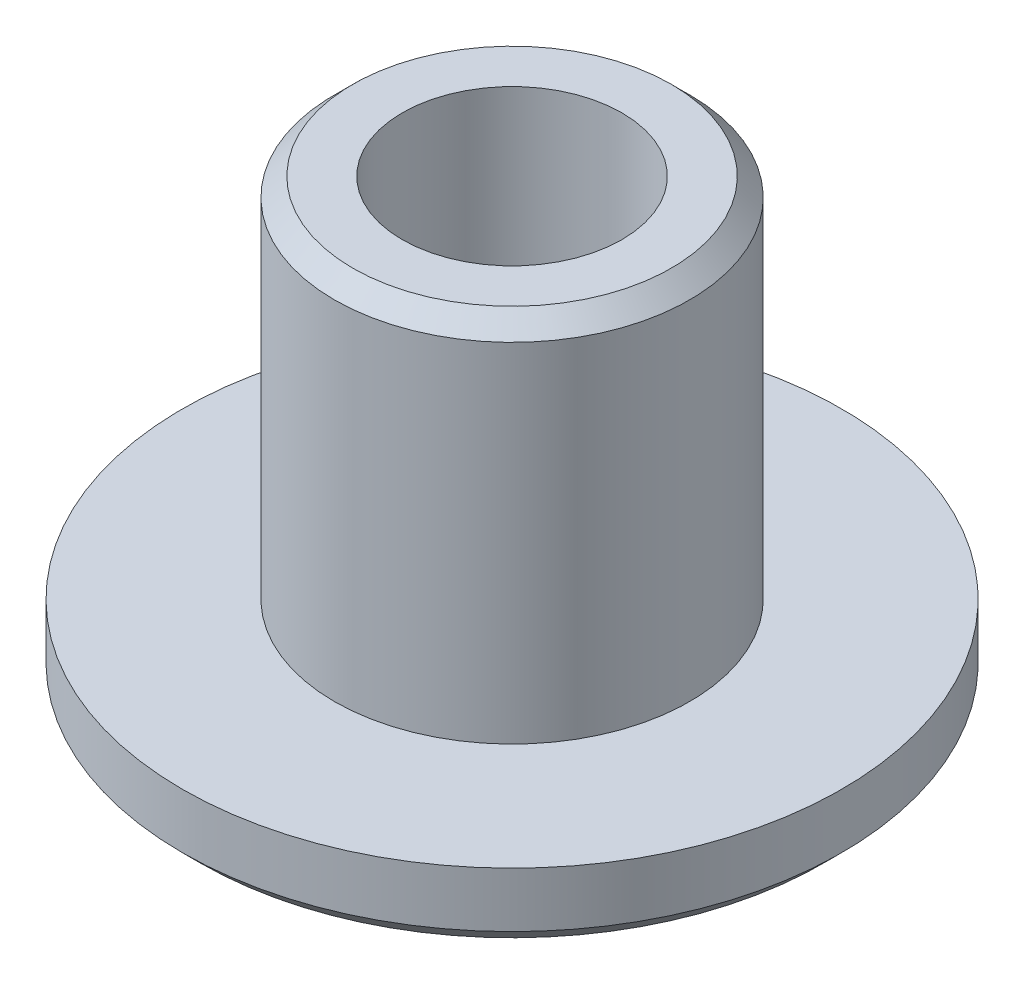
ISO-10303-21;
HEADER;
FILE_DESCRIPTION(('STEP AP214'),'2;1');
FILE_NAME('part.step','',(''),(''),'','','');
FILE_SCHEMA(('AUTOMOTIVE_DESIGN { 1 0 10303 214 1 1 1 1 }'));
ENDSEC;
DATA;
#1=APPLICATION_CONTEXT('core data for automotive mechanical design processes');
#2=APPLICATION_PROTOCOL_DEFINITION('international standard','automotive_design',2000,#1);
#3=PRODUCT_CONTEXT('',#1,'mechanical');
#4=PRODUCT('Part','Part','',(#3));
#5=PRODUCT_RELATED_PRODUCT_CATEGORY('part','',(#4));
#6=PRODUCT_DEFINITION_FORMATION('','',#4);
#7=PRODUCT_DEFINITION_CONTEXT('part definition',#1,'design');
#8=PRODUCT_DEFINITION('design','',#6,#7);
#9=PRODUCT_DEFINITION_SHAPE('','',#8);
#10=(LENGTH_UNIT() NAMED_UNIT(*) SI_UNIT(.MILLI.,.METRE.));
#11=(NAMED_UNIT(*) PLANE_ANGLE_UNIT() SI_UNIT($,.RADIAN.));
#12=(NAMED_UNIT(*) SI_UNIT($,.STERADIAN.) SOLID_ANGLE_UNIT());
#13=UNCERTAINTY_MEASURE_WITH_UNIT(LENGTH_MEASURE(1.E-05),#10,'distance_accuracy_value','');
#14=(GEOMETRIC_REPRESENTATION_CONTEXT(3) GLOBAL_UNCERTAINTY_ASSIGNED_CONTEXT((#13)) GLOBAL_UNIT_ASSIGNED_CONTEXT((#10,
#11,#12)) REPRESENTATION_CONTEXT('',''));
#15=CARTESIAN_POINT('',(0.,0.,0.));
#16=DIRECTION('',(0.,0.,1.));
#17=DIRECTION('',(1.,0.,0.));
#18=AXIS2_PLACEMENT_3D('',#15,#16,#17);
#19=CARTESIAN_POINT('',(0.,2.,0.));
#20=DIRECTION('',(0.,1.,0.));
#21=DIRECTION('',(0.,0.,1.));
#22=AXIS2_PLACEMENT_3D('',#19,#20,#21);
#23=PLANE('',#22);
#24=CARTESIAN_POINT('',(0.,2.,0.));
#25=DIRECTION('',(0.,1.,0.));
#26=DIRECTION('',(0.,0.,1.));
#27=AXIS2_PLACEMENT_3D('',#24,#25,#26);
#28=CIRCLE('',#27,9.);
#29=CARTESIAN_POINT('',(0.,2.,9.));
#30=VERTEX_POINT('',#29);
#31=EDGE_CURVE('E64',#30,#30,#28,.T.);
#32=ORIENTED_EDGE('',*,*,#31,.T.);
#33=EDGE_LOOP('',(#32));
#34=FACE_BOUND('',#33,.T.);
#35=CARTESIAN_POINT('',(0.,2.,0.));
#36=DIRECTION('',(0.,1.,0.));
#37=DIRECTION('',(0.,0.,1.));
#38=AXIS2_PLACEMENT_3D('',#35,#36,#37);
#39=CIRCLE('',#38,4.85);
#40=CARTESIAN_POINT('',(0.,2.,4.85));
#41=VERTEX_POINT('',#40);
#42=EDGE_CURVE('E72',#41,#41,#39,.T.);
#43=ORIENTED_EDGE('',*,*,#42,.F.);
#44=EDGE_LOOP('',(#43));
#45=FACE_BOUND('',#44,.T.);
#46=ADVANCED_FACE('F39',(#34,#45),#23,.T.);
#47=CARTESIAN_POINT('',(0.,0.,0.));
#48=DIRECTION('',(0.,1.,0.));
#49=DIRECTION('',(0.,0.,1.));
#50=AXIS2_PLACEMENT_3D('',#47,#48,#49);
#51=PLANE('',#50);
#52=CARTESIAN_POINT('',(0.,0.,0.));
#53=DIRECTION('',(0.,1.,0.));
#54=DIRECTION('',(0.,0.,1.));
#55=AXIS2_PLACEMENT_3D('',#52,#53,#54);
#56=CIRCLE('',#55,8.5);
#57=CARTESIAN_POINT('',(0.,0.,8.5));
#58=VERTEX_POINT('',#57);
#59=EDGE_CURVE('E53',#58,#58,#56,.F.);
#60=ORIENTED_EDGE('',*,*,#59,.T.);
#61=EDGE_LOOP('',(#60));
#62=FACE_BOUND('',#61,.T.);
#63=CARTESIAN_POINT('',(0.,0.,0.));
#64=DIRECTION('',(0.,1.,0.));
#65=DIRECTION('',(0.,0.,1.));
#66=AXIS2_PLACEMENT_3D('',#63,#64,#65);
#67=CIRCLE('',#66,3.);
#68=CARTESIAN_POINT('',(0.,0.,3.));
#69=VERTEX_POINT('',#68);
#70=EDGE_CURVE('E68',#69,#69,#67,.T.);
#71=ORIENTED_EDGE('',*,*,#70,.T.);
#72=EDGE_LOOP('',(#71));
#73=FACE_BOUND('',#72,.T.);
#74=ADVANCED_FACE('F97',(#62,#73),#51,.F.);
#75=CARTESIAN_POINT('',(0.,2.,0.));
#76=DIRECTION('',(0.,-1.,0.));
#77=DIRECTION('',(0.,0.,-1.));
#78=AXIS2_PLACEMENT_3D('',#75,#76,#77);
#79=CYLINDRICAL_SURFACE('',#78,9.);
#80=CARTESIAN_POINT('',(0.,0.5,0.));
#81=DIRECTION('',(0.,1.,0.));
#82=DIRECTION('',(0.,0.,1.));
#83=AXIS2_PLACEMENT_3D('',#80,#81,#82);
#84=CIRCLE('',#83,9.);
#85=CARTESIAN_POINT('',(0.,0.5,9.));
#86=VERTEX_POINT('',#85);
#87=EDGE_CURVE('E58',#86,#86,#84,.T.);
#88=ORIENTED_EDGE('',*,*,#87,.T.);
#89=EDGE_LOOP('',(#88));
#90=FACE_BOUND('',#89,.T.);
#91=ORIENTED_EDGE('',*,*,#31,.F.);
#92=EDGE_LOOP('',(#91));
#93=FACE_BOUND('',#92,.T.);
#94=ADVANCED_FACE('F93',(#90,#93),#79,.T.);
#95=CARTESIAN_POINT('',(0.,2.,0.));
#96=DIRECTION('',(0.,-1.,0.));
#97=DIRECTION('',(0.,0.,-1.));
#98=AXIS2_PLACEMENT_3D('',#95,#96,#97);
#99=CYLINDRICAL_SURFACE('',#98,3.);
#100=ORIENTED_EDGE('',*,*,#70,.F.);
#101=EDGE_LOOP('',(#100));
#102=FACE_BOUND('',#101,.T.);
#103=CARTESIAN_POINT('',(0.,12.,0.));
#104=DIRECTION('',(0.,1.,0.));
#105=DIRECTION('',(0.,0.,1.));
#106=AXIS2_PLACEMENT_3D('',#103,#104,#105);
#107=CIRCLE('',#106,3.);
#108=CARTESIAN_POINT('',(0.,12.,3.));
#109=VERTEX_POINT('',#108);
#110=EDGE_CURVE('E76',#109,#109,#107,.T.);
#111=ORIENTED_EDGE('',*,*,#110,.T.);
#112=EDGE_LOOP('',(#111));
#113=FACE_BOUND('',#112,.T.);
#114=ADVANCED_FACE('F81',(#102,#113),#99,.F.);
#115=CARTESIAN_POINT('',(0.,12.,0.));
#116=DIRECTION('',(0.,1.,0.));
#117=DIRECTION('',(0.,0.,1.));
#118=AXIS2_PLACEMENT_3D('',#115,#116,#117);
#119=PLANE('',#118);
#120=CARTESIAN_POINT('',(0.,12.,0.));
#121=DIRECTION('',(0.,1.,0.));
#122=DIRECTION('',(0.,0.,1.));
#123=AXIS2_PLACEMENT_3D('',#120,#121,#122);
#124=CIRCLE('',#123,4.35);
#125=CARTESIAN_POINT('',(0.,12.,4.35));
#126=VERTEX_POINT('',#125);
#127=EDGE_CURVE('E48',#126,#126,#124,.T.);
#128=ORIENTED_EDGE('',*,*,#127,.T.);
#129=EDGE_LOOP('',(#128));
#130=FACE_BOUND('',#129,.T.);
#131=ORIENTED_EDGE('',*,*,#110,.F.);
#132=EDGE_LOOP('',(#131));
#133=FACE_BOUND('',#132,.T.);
#134=ADVANCED_FACE('F83',(#130,#133),#119,.T.);
#135=CARTESIAN_POINT('',(0.,12.,0.));
#136=DIRECTION('',(0.,-1.,0.));
#137=DIRECTION('',(0.,0.,-1.));
#138=AXIS2_PLACEMENT_3D('',#135,#136,#137);
#139=CYLINDRICAL_SURFACE('',#138,4.85);
#140=CARTESIAN_POINT('',(0.,11.5,0.));
#141=DIRECTION('',(0.,1.,0.));
#142=DIRECTION('',(0.,0.,1.));
#143=AXIS2_PLACEMENT_3D('',#140,#141,#142);
#144=CIRCLE('',#143,4.85);
#145=CARTESIAN_POINT('',(0.,11.5,4.85));
#146=VERTEX_POINT('',#145);
#147=EDGE_CURVE('E10',#146,#146,#144,.F.);
#148=ORIENTED_EDGE('',*,*,#147,.T.);
#149=EDGE_LOOP('',(#148));
#150=FACE_BOUND('',#149,.T.);
#151=ORIENTED_EDGE('',*,*,#42,.T.);
#152=EDGE_LOOP('',(#151));
#153=FACE_BOUND('',#152,.T.);
#154=ADVANCED_FACE('F85',(#150,#153),#139,.T.);
#155=CARTESIAN_POINT('',(0.,0.5,0.));
#156=DIRECTION('',(0.,1.,0.));
#157=DIRECTION('',(0.,0.,1.));
#158=AXIS2_PLACEMENT_3D('',#155,#156,#157);
#159=CONICAL_SURFACE('',#158,9.,0.78539816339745);
#160=ORIENTED_EDGE('',*,*,#59,.F.);
#161=EDGE_LOOP('',(#160));
#162=FACE_BOUND('',#161,.T.);
#163=ORIENTED_EDGE('',*,*,#87,.F.);
#164=EDGE_LOOP('',(#163));
#165=FACE_BOUND('',#164,.T.);
#166=ADVANCED_FACE('F91',(#162,#165),#159,.T.);
#167=CARTESIAN_POINT('',(0.,12.,0.));
#168=DIRECTION('',(0.,-1.,0.));
#169=DIRECTION('',(0.,0.,-1.));
#170=AXIS2_PLACEMENT_3D('',#167,#168,#169);
#171=CONICAL_SURFACE('',#170,4.35,0.785398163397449);
#172=ORIENTED_EDGE('',*,*,#147,.F.);
#173=EDGE_LOOP('',(#172));
#174=FACE_BOUND('',#173,.T.);
#175=ORIENTED_EDGE('',*,*,#127,.F.);
#176=EDGE_LOOP('',(#175));
#177=FACE_BOUND('',#176,.T.);
#178=ADVANCED_FACE('F42',(#174,#177),#171,.T.);
#179=CLOSED_SHELL('',(#46,#74,#94,#114,#134,#154,#166,#178));
#180=MANIFOLD_SOLID_BREP('B2',#179);
#181=ADVANCED_BREP_SHAPE_REPRESENTATION('',(#18,#180),#14);
#182=SHAPE_DEFINITION_REPRESENTATION(#9,#181);
ENDSEC;
END-ISO-10303-21;
